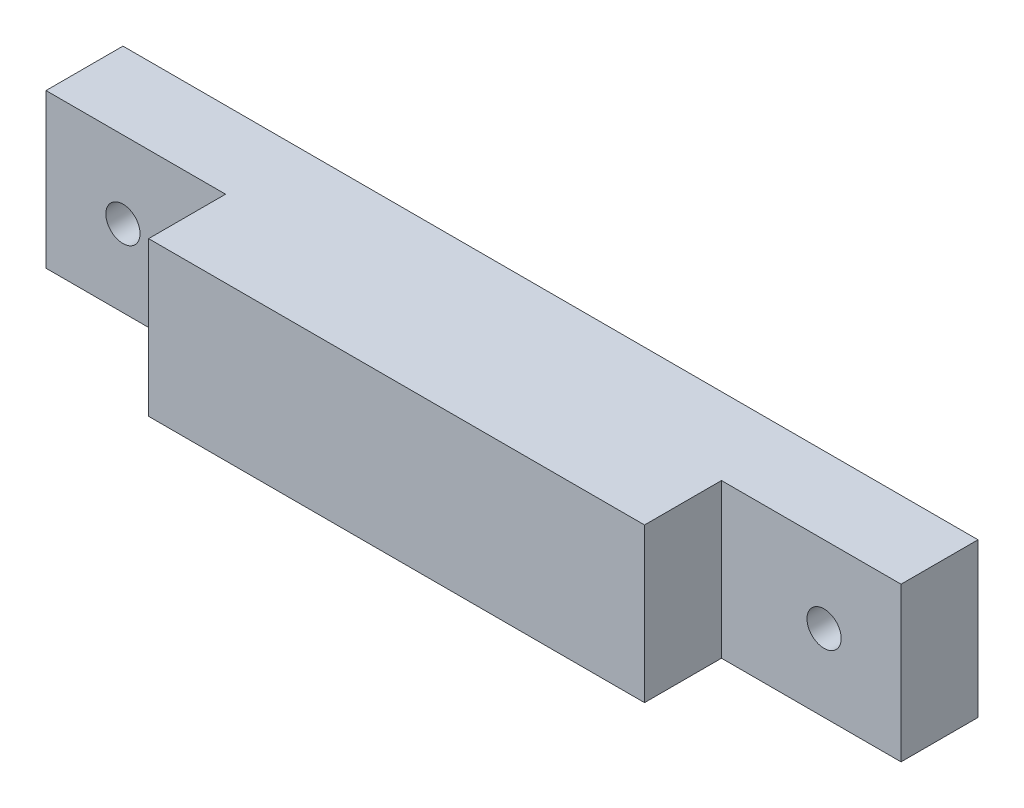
ISO-10303-21;
HEADER;
FILE_DESCRIPTION(('STEP AP214'),'2;1');
FILE_NAME('part.step','',(''),(''),'','','');
FILE_SCHEMA(('AUTOMOTIVE_DESIGN { 1 0 10303 214 1 1 1 1 }'));
ENDSEC;
DATA;
#1=APPLICATION_CONTEXT('core data for automotive mechanical design processes');
#2=APPLICATION_PROTOCOL_DEFINITION('international standard','automotive_design',2000,#1);
#3=PRODUCT_CONTEXT('',#1,'mechanical');
#4=PRODUCT('Part','Part','',(#3));
#5=PRODUCT_RELATED_PRODUCT_CATEGORY('part','',(#4));
#6=PRODUCT_DEFINITION_FORMATION('','',#4);
#7=PRODUCT_DEFINITION_CONTEXT('part definition',#1,'design');
#8=PRODUCT_DEFINITION('design','',#6,#7);
#9=PRODUCT_DEFINITION_SHAPE('','',#8);
#10=(LENGTH_UNIT() NAMED_UNIT(*) SI_UNIT(.MILLI.,.METRE.));
#11=(NAMED_UNIT(*) PLANE_ANGLE_UNIT() SI_UNIT($,.RADIAN.));
#12=(NAMED_UNIT(*) SI_UNIT($,.STERADIAN.) SOLID_ANGLE_UNIT());
#13=UNCERTAINTY_MEASURE_WITH_UNIT(LENGTH_MEASURE(1.E-05),#10,'distance_accuracy_value','');
#14=(GEOMETRIC_REPRESENTATION_CONTEXT(3) GLOBAL_UNCERTAINTY_ASSIGNED_CONTEXT((#13)) GLOBAL_UNIT_ASSIGNED_CONTEXT((#10,
#11,#12)) REPRESENTATION_CONTEXT('',''));
#15=CARTESIAN_POINT('',(0.,0.,0.));
#16=DIRECTION('',(0.,0.,1.));
#17=DIRECTION('',(1.,0.,0.));
#18=AXIS2_PLACEMENT_3D('',#15,#16,#17);
#19=CARTESIAN_POINT('',(0.,0.,9.));
#20=DIRECTION('',(0.,1.,0.));
#21=DIRECTION('',(0.,0.,1.));
#22=AXIS2_PLACEMENT_3D('',#19,#20,#21);
#23=PLANE('',#22);
#24=DIRECTION('',(0.,0.,-1.));
#25=VECTOR('',#24,1.);
#26=CARTESIAN_POINT('',(39.5,0.,10.));
#27=LINE('',#26,#25);
#28=CARTESIAN_POINT('',(39.5,0.,9.));
#29=VERTEX_POINT('',#28);
#30=CARTESIAN_POINT('',(39.5,0.,4.5));
#31=VERTEX_POINT('',#30);
#32=EDGE_CURVE('E167',#29,#31,#27,.T.);
#33=ORIENTED_EDGE('',*,*,#32,.F.);
#34=DIRECTION('',(1.,0.,0.));
#35=VECTOR('',#34,1.);
#36=CARTESIAN_POINT('',(0.,0.,9.));
#37=LINE('',#36,#35);
#38=CARTESIAN_POINT('',(10.5,0.,9.));
#39=VERTEX_POINT('',#38);
#40=EDGE_CURVE('E144',#39,#29,#37,.T.);
#41=ORIENTED_EDGE('',*,*,#40,.F.);
#42=DIRECTION('',(0.,0.,-1.));
#43=VECTOR('',#42,1.);
#44=CARTESIAN_POINT('',(10.5,0.,10.));
#45=LINE('',#44,#43);
#46=CARTESIAN_POINT('',(10.5,0.,4.5));
#47=VERTEX_POINT('',#46);
#48=EDGE_CURVE('E54',#39,#47,#45,.T.);
#49=ORIENTED_EDGE('',*,*,#48,.T.);
#50=DIRECTION('',(1.,0.,0.));
#51=VECTOR('',#50,1.);
#52=CARTESIAN_POINT('',(0.,0.,4.5));
#53=LINE('',#52,#51);
#54=CARTESIAN_POINT('',(0.,0.,4.5));
#55=VERTEX_POINT('',#54);
#56=EDGE_CURVE('E164',#55,#47,#53,.T.);
#57=ORIENTED_EDGE('',*,*,#56,.F.);
#58=DIRECTION('',(0.,0.,-1.));
#59=VECTOR('',#58,1.);
#60=CARTESIAN_POINT('',(0.,0.,9.));
#61=LINE('',#60,#59);
#62=CARTESIAN_POINT('',(0.,0.,0.));
#63=VERTEX_POINT('',#62);
#64=EDGE_CURVE('E121',#55,#63,#61,.T.);
#65=ORIENTED_EDGE('',*,*,#64,.T.);
#66=DIRECTION('',(1.,0.,0.));
#67=VECTOR('',#66,1.);
#68=CARTESIAN_POINT('',(0.,0.,0.));
#69=LINE('',#68,#67);
#70=CARTESIAN_POINT('',(50.,0.,0.));
#71=VERTEX_POINT('',#70);
#72=EDGE_CURVE('E150',#63,#71,#69,.T.);
#73=ORIENTED_EDGE('',*,*,#72,.T.);
#74=DIRECTION('',(0.,0.,-1.));
#75=VECTOR('',#74,1.);
#76=CARTESIAN_POINT('',(50.,0.,9.));
#77=LINE('',#76,#75);
#78=CARTESIAN_POINT('',(50.,0.,4.5));
#79=VERTEX_POINT('',#78);
#80=EDGE_CURVE('E118',#79,#71,#77,.T.);
#81=ORIENTED_EDGE('',*,*,#80,.F.);
#82=DIRECTION('',(1.,0.,0.));
#83=VECTOR('',#82,1.);
#84=CARTESIAN_POINT('',(50.,0.,4.5));
#85=LINE('',#84,#83);
#86=EDGE_CURVE('E46',#31,#79,#85,.T.);
#87=ORIENTED_EDGE('',*,*,#86,.F.);
#88=EDGE_LOOP('',(#33,#41,#49,#57,#65,#73,#81,#87));
#89=FACE_BOUND('',#88,.T.);
#90=ADVANCED_FACE('F31',(#89),#23,.F.);
#91=CARTESIAN_POINT('',(0.,9.,9.));
#92=DIRECTION('',(0.,-1.,0.));
#93=DIRECTION('',(0.,0.,-1.));
#94=AXIS2_PLACEMENT_3D('',#91,#92,#93);
#95=PLANE('',#94);
#96=DIRECTION('',(0.,0.,-1.));
#97=VECTOR('',#96,1.);
#98=CARTESIAN_POINT('',(39.5,9.,10.));
#99=LINE('',#98,#97);
#100=CARTESIAN_POINT('',(39.5,9.,9.));
#101=VERTEX_POINT('',#100);
#102=CARTESIAN_POINT('',(39.5,9.,4.5));
#103=VERTEX_POINT('',#102);
#104=EDGE_CURVE('E111',#101,#103,#99,.T.);
#105=ORIENTED_EDGE('',*,*,#104,.T.);
#106=DIRECTION('',(-1.,0.,0.));
#107=VECTOR('',#106,1.);
#108=CARTESIAN_POINT('',(50.,9.,4.5));
#109=LINE('',#108,#107);
#110=CARTESIAN_POINT('',(50.,9.,4.5));
#111=VERTEX_POINT('',#110);
#112=EDGE_CURVE('E98',#111,#103,#109,.T.);
#113=ORIENTED_EDGE('',*,*,#112,.F.);
#114=DIRECTION('',(0.,0.,-1.));
#115=VECTOR('',#114,1.);
#116=CARTESIAN_POINT('',(50.,9.,9.));
#117=LINE('',#116,#115);
#118=CARTESIAN_POINT('',(50.,9.,0.));
#119=VERTEX_POINT('',#118);
#120=EDGE_CURVE('E108',#111,#119,#117,.T.);
#121=ORIENTED_EDGE('',*,*,#120,.T.);
#122=DIRECTION('',(-1.,0.,0.));
#123=VECTOR('',#122,1.);
#124=CARTESIAN_POINT('',(0.,9.,0.));
#125=LINE('',#124,#123);
#126=CARTESIAN_POINT('',(0.,9.,0.));
#127=VERTEX_POINT('',#126);
#128=EDGE_CURVE('E146',#119,#127,#125,.T.);
#129=ORIENTED_EDGE('',*,*,#128,.T.);
#130=DIRECTION('',(0.,0.,-1.));
#131=VECTOR('',#130,1.);
#132=CARTESIAN_POINT('',(0.,9.,9.));
#133=LINE('',#132,#131);
#134=CARTESIAN_POINT('',(0.,9.,4.5));
#135=VERTEX_POINT('',#134);
#136=EDGE_CURVE('E119',#135,#127,#133,.T.);
#137=ORIENTED_EDGE('',*,*,#136,.F.);
#138=DIRECTION('',(-1.,0.,0.));
#139=VECTOR('',#138,1.);
#140=CARTESIAN_POINT('',(0.,9.,4.5));
#141=LINE('',#140,#139);
#142=CARTESIAN_POINT('',(10.5,9.,4.5));
#143=VERTEX_POINT('',#142);
#144=EDGE_CURVE('E136',#143,#135,#141,.T.);
#145=ORIENTED_EDGE('',*,*,#144,.F.);
#146=DIRECTION('',(0.,0.,-1.));
#147=VECTOR('',#146,1.);
#148=CARTESIAN_POINT('',(10.5,9.,10.));
#149=LINE('',#148,#147);
#150=CARTESIAN_POINT('',(10.5,9.,9.));
#151=VERTEX_POINT('',#150);
#152=EDGE_CURVE('E129',#151,#143,#149,.T.);
#153=ORIENTED_EDGE('',*,*,#152,.F.);
#154=DIRECTION('',(-1.,0.,0.));
#155=VECTOR('',#154,1.);
#156=CARTESIAN_POINT('',(0.,9.,9.));
#157=LINE('',#156,#155);
#158=EDGE_CURVE('E123',#101,#151,#157,.T.);
#159=ORIENTED_EDGE('',*,*,#158,.F.);
#160=EDGE_LOOP('',(#105,#113,#121,#129,#137,#145,#153,#159));
#161=FACE_BOUND('',#160,.T.);
#162=ADVANCED_FACE('F106',(#161),#95,.F.);
#163=CARTESIAN_POINT('',(0.,9.,9.));
#164=DIRECTION('',(0.,0.,-1.));
#165=DIRECTION('',(-1.,0.,0.));
#166=AXIS2_PLACEMENT_3D('',#163,#164,#165);
#167=PLANE('',#166);
#168=DIRECTION('',(0.,-1.,0.));
#169=VECTOR('',#168,1.);
#170=CARTESIAN_POINT('',(39.5,9.,9.));
#171=LINE('',#170,#169);
#172=EDGE_CURVE('E11',#101,#29,#171,.T.);
#173=ORIENTED_EDGE('',*,*,#172,.F.);
#174=ORIENTED_EDGE('',*,*,#158,.T.);
#175=DIRECTION('',(0.,1.,0.));
#176=VECTOR('',#175,1.);
#177=CARTESIAN_POINT('',(10.5,9.,9.));
#178=LINE('',#177,#176);
#179=EDGE_CURVE('E39',#39,#151,#178,.T.);
#180=ORIENTED_EDGE('',*,*,#179,.F.);
#181=ORIENTED_EDGE('',*,*,#40,.T.);
#182=EDGE_LOOP('',(#173,#174,#180,#181));
#183=FACE_BOUND('',#182,.T.);
#184=ADVANCED_FACE('F174',(#183),#167,.F.);
#185=CARTESIAN_POINT('',(50.,0.,9.));
#186=DIRECTION('',(-1.,0.,0.));
#187=DIRECTION('',(0.,0.,1.));
#188=AXIS2_PLACEMENT_3D('',#185,#186,#187);
#189=PLANE('',#188);
#190=DIRECTION('',(0.,1.,0.));
#191=VECTOR('',#190,1.);
#192=CARTESIAN_POINT('',(50.,0.,4.5));
#193=LINE('',#192,#191);
#194=EDGE_CURVE('E95',#79,#111,#193,.T.);
#195=ORIENTED_EDGE('',*,*,#194,.F.);
#196=ORIENTED_EDGE('',*,*,#80,.T.);
#197=DIRECTION('',(0.,1.,0.));
#198=VECTOR('',#197,1.);
#199=CARTESIAN_POINT('',(50.,0.,0.));
#200=LINE('',#199,#198);
#201=EDGE_CURVE('E116',#71,#119,#200,.T.);
#202=ORIENTED_EDGE('',*,*,#201,.T.);
#203=ORIENTED_EDGE('',*,*,#120,.F.);
#204=EDGE_LOOP('',(#195,#196,#202,#203));
#205=FACE_BOUND('',#204,.T.);
#206=ADVANCED_FACE('F114',(#205),#189,.F.);
#207=CARTESIAN_POINT('',(0.,0.,9.));
#208=DIRECTION('',(1.,0.,0.));
#209=DIRECTION('',(0.,0.,-1.));
#210=AXIS2_PLACEMENT_3D('',#207,#208,#209);
#211=PLANE('',#210);
#212=ORIENTED_EDGE('',*,*,#64,.F.);
#213=DIRECTION('',(0.,-1.,0.));
#214=VECTOR('',#213,1.);
#215=CARTESIAN_POINT('',(0.,0.,4.5));
#216=LINE('',#215,#214);
#217=EDGE_CURVE('E160',#135,#55,#216,.T.);
#218=ORIENTED_EDGE('',*,*,#217,.F.);
#219=ORIENTED_EDGE('',*,*,#136,.T.);
#220=DIRECTION('',(0.,-1.,0.));
#221=VECTOR('',#220,1.);
#222=CARTESIAN_POINT('',(0.,0.,0.));
#223=LINE('',#222,#221);
#224=EDGE_CURVE('E138',#127,#63,#223,.T.);
#225=ORIENTED_EDGE('',*,*,#224,.T.);
#226=EDGE_LOOP('',(#212,#218,#219,#225));
#227=FACE_BOUND('',#226,.T.);
#228=ADVANCED_FACE('F33',(#227),#211,.F.);
#229=CARTESIAN_POINT('',(0.,9.,0.));
#230=DIRECTION('',(0.,0.,-1.));
#231=DIRECTION('',(-1.,0.,0.));
#232=AXIS2_PLACEMENT_3D('',#229,#230,#231);
#233=PLANE('',#232);
#234=CARTESIAN_POINT('',(4.5,4.5,0.));
#235=DIRECTION('',(0.,0.,1.));
#236=DIRECTION('',(1.,0.,0.));
#237=AXIS2_PLACEMENT_3D('',#234,#235,#236);
#238=CIRCLE('',#237,1.);
#239=CARTESIAN_POINT('',(5.5,4.5,0.));
#240=VERTEX_POINT('',#239);
#241=EDGE_CURVE('E183',#240,#240,#238,.T.);
#242=ORIENTED_EDGE('',*,*,#241,.T.);
#243=EDGE_LOOP('',(#242));
#244=FACE_BOUND('',#243,.T.);
#245=CARTESIAN_POINT('',(45.5,4.5,0.));
#246=DIRECTION('',(0.,0.,1.));
#247=DIRECTION('',(1.,0.,0.));
#248=AXIS2_PLACEMENT_3D('',#245,#246,#247);
#249=CIRCLE('',#248,0.999999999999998);
#250=CARTESIAN_POINT('',(46.5,4.5,0.));
#251=VERTEX_POINT('',#250);
#252=EDGE_CURVE('E103',#251,#251,#249,.T.);
#253=ORIENTED_EDGE('',*,*,#252,.T.);
#254=EDGE_LOOP('',(#253));
#255=FACE_BOUND('',#254,.T.);
#256=ORIENTED_EDGE('',*,*,#224,.F.);
#257=ORIENTED_EDGE('',*,*,#128,.F.);
#258=ORIENTED_EDGE('',*,*,#201,.F.);
#259=ORIENTED_EDGE('',*,*,#72,.F.);
#260=EDGE_LOOP('',(#256,#257,#258,#259));
#261=FACE_BOUND('',#260,.T.);
#262=ADVANCED_FACE('F156',(#244,#255,#261),#233,.T.);
#263=CARTESIAN_POINT('',(10.5,0.,10.));
#264=DIRECTION('',(-1.,0.,0.));
#265=DIRECTION('',(0.,0.,1.));
#266=AXIS2_PLACEMENT_3D('',#263,#264,#265);
#267=PLANE('',#266);
#268=ORIENTED_EDGE('',*,*,#179,.T.);
#269=ORIENTED_EDGE('',*,*,#152,.T.);
#270=DIRECTION('',(0.,1.,0.));
#271=VECTOR('',#270,1.);
#272=CARTESIAN_POINT('',(10.5,0.,4.5));
#273=LINE('',#272,#271);
#274=EDGE_CURVE('E140',#47,#143,#273,.T.);
#275=ORIENTED_EDGE('',*,*,#274,.F.);
#276=ORIENTED_EDGE('',*,*,#48,.F.);
#277=EDGE_LOOP('',(#268,#269,#275,#276));
#278=FACE_BOUND('',#277,.T.);
#279=ADVANCED_FACE('F128',(#278),#267,.T.);
#280=CARTESIAN_POINT('',(0.,9.,4.5));
#281=DIRECTION('',(0.,0.,-1.));
#282=DIRECTION('',(-1.,0.,0.));
#283=AXIS2_PLACEMENT_3D('',#280,#281,#282);
#284=PLANE('',#283);
#285=CARTESIAN_POINT('',(4.5,4.5,4.5));
#286=DIRECTION('',(0.,0.,1.));
#287=DIRECTION('',(1.,0.,0.));
#288=AXIS2_PLACEMENT_3D('',#285,#286,#287);
#289=CIRCLE('',#288,1.);
#290=CARTESIAN_POINT('',(5.5,4.5,4.5));
#291=VERTEX_POINT('',#290);
#292=EDGE_CURVE('E186',#291,#291,#289,.T.);
#293=ORIENTED_EDGE('',*,*,#292,.F.);
#294=EDGE_LOOP('',(#293));
#295=FACE_BOUND('',#294,.T.);
#296=ORIENTED_EDGE('',*,*,#217,.T.);
#297=ORIENTED_EDGE('',*,*,#56,.T.);
#298=ORIENTED_EDGE('',*,*,#274,.T.);
#299=ORIENTED_EDGE('',*,*,#144,.T.);
#300=EDGE_LOOP('',(#296,#297,#298,#299));
#301=FACE_BOUND('',#300,.T.);
#302=ADVANCED_FACE('F170',(#295,#301),#284,.F.);
#303=CARTESIAN_POINT('',(39.5,0.,10.));
#304=DIRECTION('',(1.,0.,0.));
#305=DIRECTION('',(0.,0.,-1.));
#306=AXIS2_PLACEMENT_3D('',#303,#304,#305);
#307=PLANE('',#306);
#308=ORIENTED_EDGE('',*,*,#172,.T.);
#309=ORIENTED_EDGE('',*,*,#32,.T.);
#310=DIRECTION('',(0.,-1.,0.));
#311=VECTOR('',#310,1.);
#312=CARTESIAN_POINT('',(39.5,0.,4.5));
#313=LINE('',#312,#311);
#314=EDGE_CURVE('E112',#103,#31,#313,.T.);
#315=ORIENTED_EDGE('',*,*,#314,.F.);
#316=ORIENTED_EDGE('',*,*,#104,.F.);
#317=EDGE_LOOP('',(#308,#309,#315,#316));
#318=FACE_BOUND('',#317,.T.);
#319=ADVANCED_FACE('F176',(#318),#307,.T.);
#320=CARTESIAN_POINT('',(50.,9.,4.5));
#321=DIRECTION('',(0.,0.,1.));
#322=DIRECTION('',(1.,0.,0.));
#323=AXIS2_PLACEMENT_3D('',#320,#321,#322);
#324=PLANE('',#323);
#325=CARTESIAN_POINT('',(45.5,4.5,4.5));
#326=DIRECTION('',(0.,0.,1.));
#327=DIRECTION('',(1.,0.,0.));
#328=AXIS2_PLACEMENT_3D('',#325,#326,#327);
#329=CIRCLE('',#328,0.999999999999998);
#330=CARTESIAN_POINT('',(46.5,4.5,4.5));
#331=VERTEX_POINT('',#330);
#332=EDGE_CURVE('E180',#331,#331,#329,.T.);
#333=ORIENTED_EDGE('',*,*,#332,.F.);
#334=EDGE_LOOP('',(#333));
#335=FACE_BOUND('',#334,.T.);
#336=ORIENTED_EDGE('',*,*,#194,.T.);
#337=ORIENTED_EDGE('',*,*,#112,.T.);
#338=ORIENTED_EDGE('',*,*,#314,.T.);
#339=ORIENTED_EDGE('',*,*,#86,.T.);
#340=EDGE_LOOP('',(#336,#337,#338,#339));
#341=FACE_BOUND('',#340,.T.);
#342=ADVANCED_FACE('F97',(#335,#341),#324,.T.);
#343=CARTESIAN_POINT('',(45.5,4.5,0.));
#344=DIRECTION('',(0.,0.,1.));
#345=DIRECTION('',(1.,0.,0.));
#346=AXIS2_PLACEMENT_3D('',#343,#344,#345);
#347=CYLINDRICAL_SURFACE('',#346,0.999999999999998);
#348=ORIENTED_EDGE('',*,*,#252,.F.);
#349=EDGE_LOOP('',(#348));
#350=FACE_BOUND('',#349,.T.);
#351=ORIENTED_EDGE('',*,*,#332,.T.);
#352=EDGE_LOOP('',(#351));
#353=FACE_BOUND('',#352,.T.);
#354=ADVANCED_FACE('F197',(#350,#353),#347,.F.);
#355=CARTESIAN_POINT('',(4.5,4.5,0.));
#356=DIRECTION('',(0.,0.,1.));
#357=DIRECTION('',(1.,0.,0.));
#358=AXIS2_PLACEMENT_3D('',#355,#356,#357);
#359=CYLINDRICAL_SURFACE('',#358,1.);
#360=ORIENTED_EDGE('',*,*,#241,.F.);
#361=EDGE_LOOP('',(#360));
#362=FACE_BOUND('',#361,.T.);
#363=ORIENTED_EDGE('',*,*,#292,.T.);
#364=EDGE_LOOP('',(#363));
#365=FACE_BOUND('',#364,.T.);
#366=ADVANCED_FACE('F194',(#362,#365),#359,.F.);
#367=CLOSED_SHELL('',(#90,#162,#184,#206,#228,#262,#279,#302,#319,#342,#354,#366));
#368=MANIFOLD_SOLID_BREP('B2',#367);
#369=ADVANCED_BREP_SHAPE_REPRESENTATION('',(#18,#368),#14);
#370=SHAPE_DEFINITION_REPRESENTATION(#9,#369);
ENDSEC;
END-ISO-10303-21;
